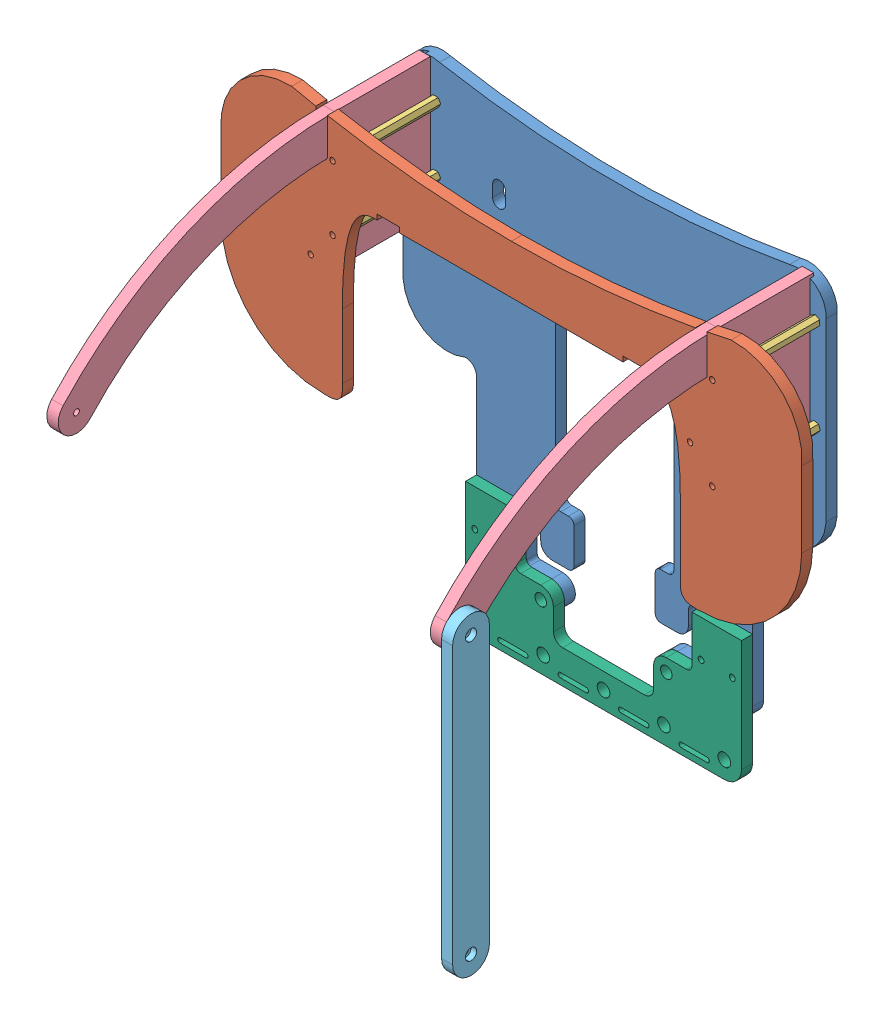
SolidWorks assembly sborka.SLDASM, configuration Default (file format 7000). Lengths in mm.
Overall size (315.56 258.58 208.04).
14 component instances, 6 part files, 29 mates.
Components (placement in the parent):
- niz-1: niz.SLDPRT [Default] at (-2.0493 -62.1345 346.4197) size (229.8 226.77 6)
- verh-1: verh.SLDPRT [Default] at (394.0344 534.0135 402.4197) x (-1 0 0) z (0 0 1) size (315.56 136.4 6)
- 50mm M3 hex spacer-1: 50mm M3 hex spacer.SLDPRT [Default] at (86.9715 373.6472 402.4197) x (0.510414 -0.859929 0) z (0.859929 0.510414 0) size (5.43 50 4.7)
- 50mm M3 hex spacer-3: 50mm M3 hex spacer.SLDPRT [Default] at (86.9715 323.6472 402.4197) x (0.510414 -0.859929 0) z (0.859929 0.510414 0) size (5.43 50 4.7)
- 50mm M3 hex spacer-4: 50mm M3 hex spacer.SLDPRT [Default] at (305.0409 373.6472 402.4197) x (-0.849062 -0.528293 0) z (0.528293 -0.849062 0) size (5.43 50 4.7)
- 50mm M3 hex spacer-5: 50mm M3 hex spacer.SLDPRT [Default] at (305.0409 323.6472 402.4197) x (-0.357195 0.93403 0) z (-0.93403 -0.357195 0) size (5.43 50 4.7)
- 50mm M3 hex spacer-6: 50mm M3 hex spacer.SLDPRT [Default] at (98.8715 338.6472 402.4197) x (0.510414 -0.859929 0) z (0.859929 0.510414 0) size (5.43 50 4.7)
- 50mm M3 hex spacer-7: 50mm M3 hex spacer.SLDPRT [Default] at (98.8715 373.6472 402.4197) x (0.510414 -0.859929 0) z (0.859929 0.510414 0) size (5.43 50 4.7)
- 50mm M3 hex spacer-8: 50mm M3 hex spacer.SLDPRT [Default] at (293.1024 373.3031 402.4197) x (-0.912564 -0.408934 0) z (0.408934 -0.912564 0) size (5.43 50 4.7)
- 50mm M3 hex spacer-9: 50mm M3 hex spacer.SLDPRT [Default] at (292.9785 338.3034 402.4197) x (-0.849062 -0.528293 0) z (0.528293 -0.849062 0) size (5.43 50 4.7)
- ruchka 1-1: ruchka 1.SLDPRT [Default] at (295.9268 393.5723 350.4197) x (1 0.000569 0) z (0.000569 -1 0) size (6.2 202.04 81.23)
- ruchka 1-2: ruchka 1.SLDPRT [Default] at (89.7715 393.224 352.4197) x (1 0 0) z (0 -1 0) size (6.2 202.04 81.23)
- ruchka 2-1: ruchka 2.SLDPRT [Default] at (302.2528 172.2774 542.609) x (0 -0.000569 -1) z (1 0.000569 0) size (20 170 6)
- pod cameru-1: pod cameru.SLDPRT [Default] at (-2.0493 -61.7105 352.4197) size (149.87 70 6)
Mates (geometry in assembly coordinates):
- Parallel5: parallel aligned: plane of niz-1 through (-2.0493 305.7411 352.4197) normal (0 -1 0); plane of verh-1 through (394.0344 357.8489 408.4197) normal (0 -1 0)
- Parallel6: parallel aligned: line of niz-1 through (196.0062 305.7411 352.4197) axis (0 1 0); line of verh-1 through (195.9593 357.8489 408.4197) axis (0 1 0)
- Coincident3: coincident: moEndPointRef_w of niz-1; line of verh-1 through (196.0062 384.3217 408.4197) axis (0 0 -1)
- Coincident4: coincident anti-aligned: plane of niz-1 through (-2.0493 -62.1345 352.4197) normal (0 0 1); plane of 50mm M3 hex spacer-1 through (86.9715 373.6472 352.4197) normal (0 0 -1)
- Concentric9: concentric anti-aligned: cylinder of niz-1 through (86.9715 373.6472 352.4197) axis (0 0 -1) radius 1.6; cylinder of 50mm M3 hex spacer-1 through (86.9715 373.6472 352.4197) axis (0 0 1) radius 1.5
- Coincident5: coincident anti-aligned: plane of niz-1 through (-2.0493 -62.1345 352.4197) normal (0 0 1); plane of 50mm M3 hex spacer-3 through (86.9715 323.6472 352.4197) normal (0 0 -1)
- Concentric10: concentric anti-aligned: cylinder of niz-1 through (86.9715 323.6472 352.4197) axis (0 0 -1) radius 1.6; cylinder of 50mm M3 hex spacer-3 through (86.9715 323.6472 352.4197) axis (0 0 1) radius 1.5
- Coincident6: coincident anti-aligned: plane of niz-1 through (-2.0493 -62.1345 352.4197) normal (0 0 1); plane of 50mm M3 hex spacer-4 through (305.0409 373.6472 352.4197) normal (0 0 -1)
- Concentric11: concentric anti-aligned: cylinder of niz-1 through (305.0409 373.6472 352.4197) axis (0 0 -1) radius 1.6; cylinder of 50mm M3 hex spacer-4 through (305.0409 373.6472 352.4197) axis (0 0 1) radius 1.5
- Coincident7: coincident anti-aligned: plane of niz-1 through (-2.0493 -62.1345 352.4197) normal (0 0 1); plane of 50mm M3 hex spacer-5 through (305.0409 323.6472 352.4197) normal (0 0 -1)
- Concentric12: concentric anti-aligned: cylinder of niz-1 through (305.0409 323.6472 352.4197) axis (0 0 -1) radius 1.6; cylinder of 50mm M3 hex spacer-5 through (305.0409 323.6472 352.4197) axis (0 0 1) radius 1.5
- Coincident8: coincident anti-aligned: plane of verh-1 through (394.0344 534.0135 402.4197) normal (0 0 -1); plane of 50mm M3 hex spacer-1 through (86.9715 373.6472 402.4197) normal (0 0 1)
- Coincident11: coincident anti-aligned: plane of niz-1 through (-2.0493 -62.1345 352.4197) normal (0 0 1); plane of 50mm M3 hex spacer-7 through (98.8715 373.6472 352.4197) normal (0 0 -1)
- Coincident12: coincident anti-aligned: plane of niz-1 through (-2.0493 -62.1345 352.4197) normal (0 0 1); plane of 50mm M3 hex spacer-6 through (98.8715 338.6472 352.4197) normal (0 0 -1)
- Concentric13: concentric anti-aligned: cylinder of verh-1 through (98.8715 373.6472 412.4197) axis (0 0 -1) radius 1.5; cylinder of 50mm M3 hex spacer-7 through (98.8715 373.6472 352.4197) axis (0 0 1) radius 1.5
- Concentric14: concentric anti-aligned: cylinder of verh-1 through (98.8715 338.6472 412.4197) axis (0 0 -1) radius 1.5; cylinder of 50mm M3 hex spacer-6 through (98.8715 338.6472 352.4197) axis (0 0 1) radius 1.5
- Concentric15: concentric anti-aligned: cylinder of verh-1 through (292.9785 338.3034 412.4197) axis (0 0 -1) radius 1.5; cylinder of 50mm M3 hex spacer-9 through (292.9785 338.3034 352.4197) axis (0 0 1) radius 1.5
- Coincident13: coincident anti-aligned: plane of niz-1 through (-2.0493 -62.1345 352.4197) normal (0 0 1); plane of 50mm M3 hex spacer-9 through (292.9785 338.3034 352.4197) normal (0 0 -1)
- Concentric16: concentric anti-aligned: cylinder of verh-1 through (293.1024 373.3031 412.4197) axis (0 0 -1) radius 1.5; cylinder of 50mm M3 hex spacer-8 through (293.1024 373.3031 352.4197) axis (0 0 1) radius 1.5
- Coincident14: coincident anti-aligned: plane of niz-1 through (-2.0493 -62.1345 352.4197) normal (0 0 1); plane of 50mm M3 hex spacer-8 through (293.1024 373.3031 352.4197) normal (0 0 -1)
- Coincident15: coincident anti-aligned: plane of verh-1 through (394.0344 534.0135 402.4197) normal (0 0 -1); plane of ruchka 1-1 through (302.1689 319.5758 402.4197) normal (0 0 1)
- Coincident16: coincident anti-aligned: plane of verh-1 through (302.0468 533.9611 408.4197) normal (-1 -0.000569 0); plane of ruchka 1-1 through (302.241 193.0207 402.4197) normal (1 0.000569 0)
- Coincident17: coincident aligned: line of verh-1 through (302.1381 373.7076 402.4197) axis (-1 -0.000569 0); line of ruchka 1-1 through (302.1381 373.7076 402.4197) axis (-1 -0.000569 0)
- Coincident18: coincident anti-aligned: plane of niz-1 through (-2.0493 -62.1345 352.4197) normal (0 0 1); plane of ruchka 1-2 through (95.9715 393.224 352.4197) normal (0 0 -1)
- Coincident19: coincident anti-aligned: plane of verh-1 through (89.7715 534.0135 408.4197) normal (1 0 0); plane of ruchka 1-2 through (89.7715 192.6688 404.4197) normal (-1 0 0)
- Coincident20: coincident anti-aligned: plane of ruchka 1-1 through (302.241 193.0207 402.4197) normal (1 0.000569 0); plane of ruchka 2-1 through (302.2528 172.2774 542.609) normal (-1 -0.000569 0)
- Concentric17: concentric aligned: cylinder of ruchka 1-1 through (302.1674 322.2774 542.5236) axis (-1 -0.000569 0) radius 1.6; cylinder of ruchka 2-1 through (308.1674 322.2808 542.5236) axis (-1 -0.000569 0) radius 1.6
- Concentric18: concentric aligned: cylinder of niz-1 through (230.0913 173.6915 352.4197) axis (0 0 -1) radius 2.9839; cylinder of pod cameru-1 through (230.0913 173.6915 358.4197) axis (0 0 -1) radius 3.15
- Coincident21: coincident anti-aligned: plane of niz-1 through (-2.0493 -62.1345 352.4197) normal (0 0 1); plane of pod cameru-1 through (-2.0493 -61.7105 352.4197) normal (0 0 -1)
